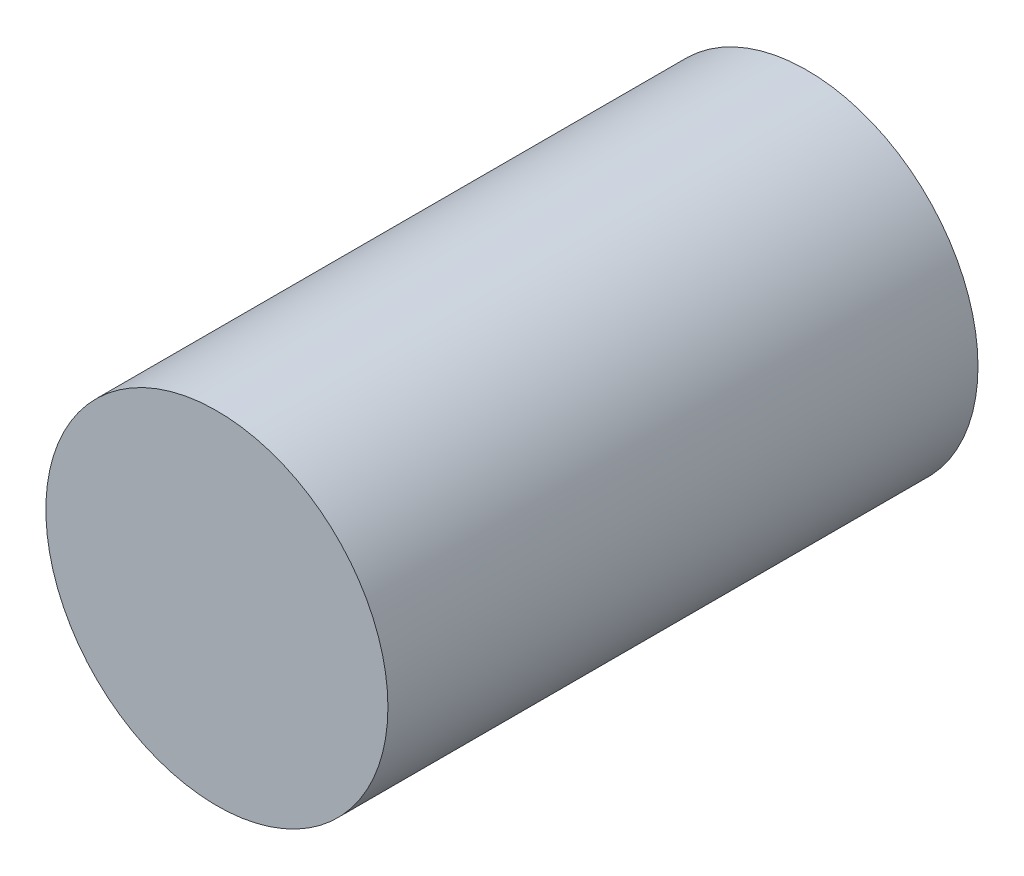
from build123d import *

# Parameters (mm, degrees)
ESQCYLINDRE_R  = 20
CYLINDRE_DEPTH = 69


with BuildPart() as part:
    # EsqCylindre → Cylindre (new body)
    with BuildSketch(Plane.XY):
        Circle(ESQCYLINDRE_R)
    extrude(amount=-CYLINDRE_DEPTH)


solid = part.part
